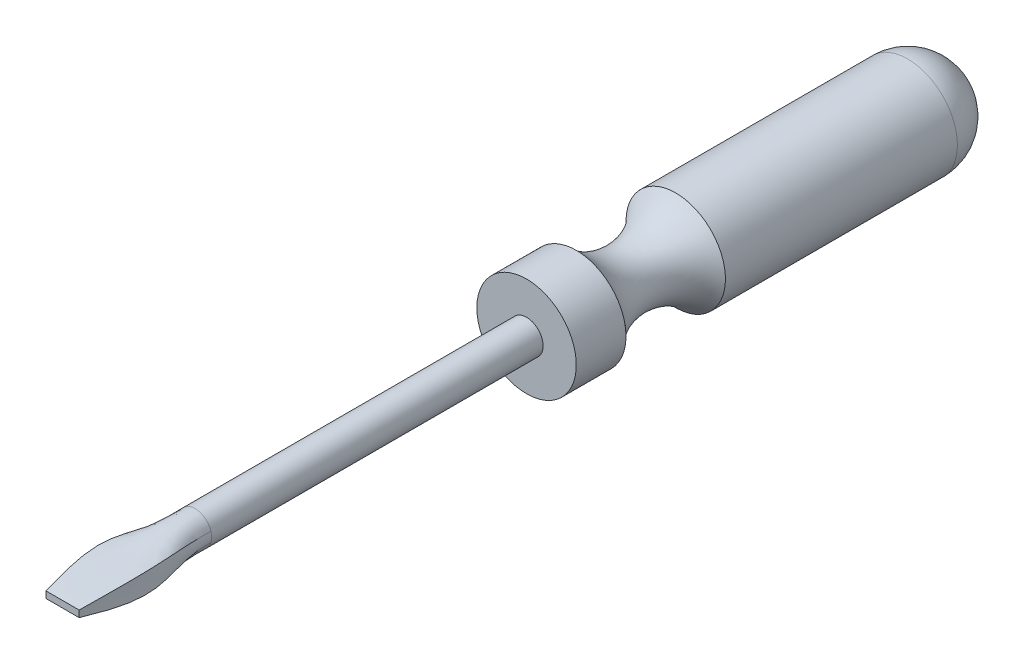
ISO-10303-21;
HEADER;
FILE_DESCRIPTION(('STEP AP214'),'2;1');
FILE_NAME('part.step','',(''),(''),'','','');
FILE_SCHEMA(('AUTOMOTIVE_DESIGN { 1 0 10303 214 1 1 1 1 }'));
ENDSEC;
DATA;
#1=APPLICATION_CONTEXT('core data for automotive mechanical design processes');
#2=APPLICATION_PROTOCOL_DEFINITION('international standard','automotive_design',2000,#1);
#3=PRODUCT_CONTEXT('',#1,'mechanical');
#4=PRODUCT('Part','Part','',(#3));
#5=PRODUCT_RELATED_PRODUCT_CATEGORY('part','',(#4));
#6=PRODUCT_DEFINITION_FORMATION('','',#4);
#7=PRODUCT_DEFINITION_CONTEXT('part definition',#1,'design');
#8=PRODUCT_DEFINITION('design','',#6,#7);
#9=PRODUCT_DEFINITION_SHAPE('','',#8);
#10=(LENGTH_UNIT() NAMED_UNIT(*) SI_UNIT(.MILLI.,.METRE.));
#11=(NAMED_UNIT(*) PLANE_ANGLE_UNIT() SI_UNIT($,.RADIAN.));
#12=(NAMED_UNIT(*) SI_UNIT($,.STERADIAN.) SOLID_ANGLE_UNIT());
#13=UNCERTAINTY_MEASURE_WITH_UNIT(LENGTH_MEASURE(1.E-05),#10,'distance_accuracy_value','');
#14=(GEOMETRIC_REPRESENTATION_CONTEXT(3) GLOBAL_UNCERTAINTY_ASSIGNED_CONTEXT((#13)) GLOBAL_UNIT_ASSIGNED_CONTEXT((#10,
#11,#12)) REPRESENTATION_CONTEXT('',''));
#15=CARTESIAN_POINT('',(0.,0.,0.));
#16=DIRECTION('',(0.,0.,1.));
#17=DIRECTION('',(1.,0.,0.));
#18=AXIS2_PLACEMENT_3D('',#15,#16,#17);
#19=CARTESIAN_POINT('',(0.,0.,0.));
#20=DIRECTION('',(0.,0.,-1.));
#21=DIRECTION('',(-1.,0.,0.));
#22=AXIS2_PLACEMENT_3D('',#19,#20,#21);
#23=PLANE('',#22);
#24=CARTESIAN_POINT('',(0.,0.,0.));
#25=DIRECTION('',(0.,0.,-1.));
#26=DIRECTION('',(-1.,0.,0.));
#27=AXIS2_PLACEMENT_3D('',#24,#25,#26);
#28=CIRCLE('',#27,19.05);
#29=CARTESIAN_POINT('',(-19.05,0.,0.));
#30=VERTEX_POINT('',#29);
#31=EDGE_CURVE('E163',#30,#30,#28,.T.);
#32=ORIENTED_EDGE('',*,*,#31,.F.);
#33=EDGE_LOOP('',(#32));
#34=FACE_BOUND('',#33,.T.);
#35=CARTESIAN_POINT('',(0.,0.,0.));
#36=DIRECTION('',(0.,0.,-1.));
#37=DIRECTION('',(-1.,0.,0.));
#38=AXIS2_PLACEMENT_3D('',#35,#36,#37);
#39=CIRCLE('',#38,6.35);
#40=CARTESIAN_POINT('',(-6.35,0.,0.));
#41=VERTEX_POINT('',#40);
#42=EDGE_CURVE('E12',#41,#41,#39,.F.);
#43=ORIENTED_EDGE('',*,*,#42,.F.);
#44=EDGE_LOOP('',(#43));
#45=FACE_BOUND('',#44,.T.);
#46=ADVANCED_FACE('F154',(#34,#45),#23,.F.);
#47=CARTESIAN_POINT('',(0.,0.,0.));
#48=DIRECTION('',(0.,0.,-1.));
#49=DIRECTION('',(-1.,0.,0.));
#50=AXIS2_PLACEMENT_3D('',#47,#48,#49);
#51=CYLINDRICAL_SURFACE('',#50,19.05);
#52=CARTESIAN_POINT('',(0.,0.,-19.05));
#53=DIRECTION('',(0.,0.,-1.));
#54=DIRECTION('',(-1.,0.,0.));
#55=AXIS2_PLACEMENT_3D('',#52,#53,#54);
#56=CIRCLE('',#55,19.05);
#57=CARTESIAN_POINT('',(-19.05,0.,-19.05));
#58=VERTEX_POINT('',#57);
#59=EDGE_CURVE('E457',#58,#58,#56,.T.);
#60=ORIENTED_EDGE('',*,*,#59,.F.);
#61=EDGE_LOOP('',(#60));
#62=FACE_BOUND('',#61,.T.);
#63=ORIENTED_EDGE('',*,*,#31,.T.);
#64=EDGE_LOOP('',(#63));
#65=FACE_BOUND('',#64,.T.);
#66=ADVANCED_FACE('F423',(#62,#65),#51,.T.);
#67=CARTESIAN_POINT('',(0.,0.,-38.1));
#68=DIRECTION('',(0.,0.,-1.));
#69=DIRECTION('',(-1.,0.,0.));
#70=AXIS2_PLACEMENT_3D('',#67,#68,#69);
#71=TOROIDAL_SURFACE('',#70,35.8505208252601,25.4);
#72=CARTESIAN_POINT('',(0.,0.,-57.15));
#73=DIRECTION('',(0.,0.,-1.));
#74=DIRECTION('',(-1.,0.,0.));
#75=AXIS2_PLACEMENT_3D('',#72,#73,#74);
#76=CIRCLE('',#75,19.05);
#77=CARTESIAN_POINT('',(-19.05,0.,-57.15));
#78=VERTEX_POINT('',#77);
#79=EDGE_CURVE('E459',#78,#78,#76,.T.);
#80=ORIENTED_EDGE('',*,*,#79,.F.);
#81=EDGE_LOOP('',(#80));
#82=FACE_BOUND('',#81,.T.);
#83=ORIENTED_EDGE('',*,*,#59,.T.);
#84=EDGE_LOOP('',(#83));
#85=FACE_BOUND('',#84,.T.);
#86=ADVANCED_FACE('F428',(#82,#85),#71,.F.);
#87=CARTESIAN_POINT('',(0.,0.,0.));
#88=DIRECTION('',(0.,0.,-1.));
#89=DIRECTION('',(-1.,0.,0.));
#90=AXIS2_PLACEMENT_3D('',#87,#88,#89);
#91=CYLINDRICAL_SURFACE('',#90,19.05);
#92=CARTESIAN_POINT('',(0.,0.,-146.05));
#93=DIRECTION('',(0.,0.,-1.));
#94=DIRECTION('',(-1.,0.,0.));
#95=AXIS2_PLACEMENT_3D('',#92,#93,#94);
#96=CIRCLE('',#95,19.05);
#97=CARTESIAN_POINT('',(-19.05,0.,-146.05));
#98=VERTEX_POINT('',#97);
#99=EDGE_CURVE('E242',#98,#98,#96,.T.);
#100=ORIENTED_EDGE('',*,*,#99,.F.);
#101=EDGE_LOOP('',(#100));
#102=FACE_BOUND('',#101,.T.);
#103=ORIENTED_EDGE('',*,*,#79,.T.);
#104=EDGE_LOOP('',(#103));
#105=FACE_BOUND('',#104,.T.);
#106=ADVANCED_FACE('F440',(#102,#105),#91,.T.);
#107=CARTESIAN_POINT('',(0.,0.,-146.05));
#108=DIRECTION('',(0.,0.,-1.));
#109=DIRECTION('',(1.,0.,0.));
#110=AXIS2_PLACEMENT_3D('',#107,#108,#109);
#111=SPHERICAL_SURFACE('',#110,19.05);
#112=ORIENTED_EDGE('',*,*,#99,.T.);
#113=EDGE_LOOP('',(#112));
#114=FACE_BOUND('',#113,.T.);
#115=ADVANCED_FACE('F436',(#114),#111,.T.);
#116=CARTESIAN_POINT('',(0.,0.,144.960512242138));
#117=DIRECTION('',(0.,0.,-1.));
#118=DIRECTION('',(-1.,0.,0.));
#119=AXIS2_PLACEMENT_3D('',#116,#117,#118);
#120=CYLINDRICAL_SURFACE('',#119,6.35);
#121=ORIENTED_EDGE('',*,*,#42,.T.);
#122=EDGE_LOOP('',(#121));
#123=FACE_BOUND('',#122,.T.);
#124=CARTESIAN_POINT('',(6.06423657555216,1.88349004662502,127.));
#125=CARTESIAN_POINT('',(5.58596095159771,3.42338484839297,127.));
#126=CARTESIAN_POINT('',(4.61525119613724,4.81003866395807,127.));
#127=CARTESIAN_POINT('',(3.22482013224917,5.83395313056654,127.000000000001));
#128=CARTESIAN_POINT('',(0.,6.86623014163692,126.999999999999));
#129=CARTESIAN_POINT('',(-3.22482013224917,5.83395313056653,127.000000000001));
#130=CARTESIAN_POINT('',(-4.61525119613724,4.8100386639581,127.000000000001));
#131=CARTESIAN_POINT('',(-5.58596095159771,3.42338484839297,127.));
#132=CARTESIAN_POINT('',(-6.06423657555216,1.88349004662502,127.));
#133=B_SPLINE_CURVE_WITH_KNOTS('',5,(#124,#125,#126,#127,#128,#129,#130,#131,#132),
.UNSPECIFIED.,.F.,.F.,(6,3,6),(0.,0.5,1.),.UNSPECIFIED.);
#134=CARTESIAN_POINT('',(6.06451282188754,1.88357672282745,127.));
#135=VERTEX_POINT('',#134);
#136=CARTESIAN_POINT('',(-6.06453522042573,1.88358375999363,127.));
#137=VERTEX_POINT('',#136);
#138=EDGE_CURVE('E223',#135,#137,#133,.T.);
#139=ORIENTED_EDGE('',*,*,#138,.F.);
#140=CARTESIAN_POINT('',(0.,0.,127.));
#141=DIRECTION('',(0.,0.,1.));
#142=DIRECTION('',(1.,0.,0.));
#143=AXIS2_PLACEMENT_3D('',#140,#141,#142);
#144=CIRCLE('',#143,6.35);
#145=CARTESIAN_POINT('',(6.06453920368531,-1.8835850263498,127.));
#146=VERTEX_POINT('',#145);
#147=EDGE_CURVE('E171',#135,#146,#144,.F.);
#148=ORIENTED_EDGE('',*,*,#147,.T.);
#149=CARTESIAN_POINT('',(0.,0.,127.));
#150=DIRECTION('',(0.,0.,-1.));
#151=DIRECTION('',(1.,0.,0.));
#152=AXIS2_PLACEMENT_3D('',#149,#150,#151);
#153=CIRCLE('',#152,6.35);
#154=CARTESIAN_POINT('',(-6.06451679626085,-1.88357798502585,127.));
#155=VERTEX_POINT('',#154);
#156=EDGE_CURVE('E176',#146,#155,#153,.T.);
#157=ORIENTED_EDGE('',*,*,#156,.T.);
#158=CARTESIAN_POINT('',(0.,0.,127.));
#159=DIRECTION('',(0.,0.,-1.));
#160=DIRECTION('',(1.,0.,0.));
#161=AXIS2_PLACEMENT_3D('',#158,#159,#160);
#162=CIRCLE('',#161,6.35);
#163=EDGE_CURVE('E206',#155,#137,#162,.T.);
#164=ORIENTED_EDGE('',*,*,#163,.T.);
#165=EDGE_LOOP('',(#139,#148,#157,#164));
#166=FACE_BOUND('',#165,.T.);
#167=ADVANCED_FACE('F253',(#123,#166),#120,.T.);
#168=CARTESIAN_POINT('',(0.,0.,177.8));
#169=DIRECTION('',(0.,0.,-1.));
#170=DIRECTION('',(-1.,0.,0.));
#171=AXIS2_PLACEMENT_3D('',#168,#169,#170);
#172=PLANE('',#171);
#173=DIRECTION('',(0.,-1.,0.));
#174=VECTOR('',#173,1.);
#175=CARTESIAN_POINT('',(-6.35,-1.27,177.8));
#176=LINE('',#175,#174);
#177=CARTESIAN_POINT('',(-6.35,1.27,177.8));
#178=VERTEX_POINT('',#177);
#179=CARTESIAN_POINT('',(-6.35,-1.27,177.8));
#180=VERTEX_POINT('',#179);
#181=EDGE_CURVE('E203',#178,#180,#176,.T.);
#182=ORIENTED_EDGE('',*,*,#181,.T.);
#183=DIRECTION('',(1.,0.,0.));
#184=VECTOR('',#183,1.);
#185=CARTESIAN_POINT('',(-6.35,-1.27,177.8));
#186=LINE('',#185,#184);
#187=CARTESIAN_POINT('',(6.35,-1.27,177.8));
#188=VERTEX_POINT('',#187);
#189=EDGE_CURVE('E215',#180,#188,#186,.T.);
#190=ORIENTED_EDGE('',*,*,#189,.T.);
#191=DIRECTION('',(0.,1.,0.));
#192=VECTOR('',#191,1.);
#193=CARTESIAN_POINT('',(6.35,-1.27,177.8));
#194=LINE('',#193,#192);
#195=CARTESIAN_POINT('',(6.35,1.27,177.8));
#196=VERTEX_POINT('',#195);
#197=EDGE_CURVE('E224',#188,#196,#194,.T.);
#198=ORIENTED_EDGE('',*,*,#197,.T.);
#199=DIRECTION('',(-1.,0.,0.));
#200=VECTOR('',#199,1.);
#201=CARTESIAN_POINT('',(-6.35,1.27,177.8));
#202=LINE('',#201,#200);
#203=EDGE_CURVE('E231',#196,#178,#202,.T.);
#204=ORIENTED_EDGE('',*,*,#203,.T.);
#205=EDGE_LOOP('',(#182,#190,#198,#204));
#206=FACE_BOUND('',#205,.T.);
#207=ADVANCED_FACE('F229',(#206),#172,.F.);
#208=CARTESIAN_POINT('',(-6.35,1.27,177.8));
#209=CARTESIAN_POINT('',(-7.24669827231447,2.08925590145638,172.722712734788));
#210=CARTESIAN_POINT('',(-8.14339654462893,2.90851180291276,167.645425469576));
#211=CARTESIAN_POINT('',(-8.84574568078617,3.57213975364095,162.566781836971));
#212=CARTESIAN_POINT('',(-9.47201583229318,4.27572492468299,152.420781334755));
#213=CARTESIAN_POINT('',(-7.77376045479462,3.11791183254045,142.258557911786));
#214=CARTESIAN_POINT('',(-6.06423657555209,1.88349004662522,137.189031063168));
#215=CARTESIAN_POINT('',(-6.06423657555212,1.88349004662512,132.094515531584));
#216=CARTESIAN_POINT('',(-6.06423657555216,1.88349004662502,127.));
#217=CARTESIAN_POINT('',(-5.08,1.27,177.8));
#218=CARTESIAN_POINT('',(-5.73409838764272,1.9566424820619,172.73260214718));
#219=CARTESIAN_POINT('',(-6.38819677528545,2.6432849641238,167.66520429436));
#220=CARTESIAN_POINT('',(-6.91844596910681,3.24060620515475,162.59150536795));
#221=CARTESIAN_POINT('',(-7.48261829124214,4.07658671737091,152.435631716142));
#222=CARTESIAN_POINT('',(-6.56548424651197,3.84423469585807,142.204393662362));
#223=CARTESIAN_POINT('',(-5.58596107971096,3.42338443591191,137.051229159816));
#224=CARTESIAN_POINT('',(-5.58596101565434,3.42338464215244,132.025614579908));
#225=CARTESIAN_POINT('',(-5.58596095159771,3.42338484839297,127.));
#226=CARTESIAN_POINT('',(-3.81,1.27,177.8));
#227=CARTESIAN_POINT('',(-4.26390620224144,1.83722593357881,172.740019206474));
#228=CARTESIAN_POINT('',(-4.71781240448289,2.40445186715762,167.680038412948));
#229=CARTESIAN_POINT('',(-5.09716550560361,2.94206483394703,162.610048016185));
#230=CARTESIAN_POINT('',(-5.55690203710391,3.89726551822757,152.446769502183));
#231=CARTESIAN_POINT('',(-5.12494133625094,4.4982783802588,142.163770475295));
#232=CARTESIAN_POINT('',(-4.61525138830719,4.8100380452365,136.947877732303));
#233=CARTESIAN_POINT('',(-4.61525129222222,4.8100383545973,131.973938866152));
#234=CARTESIAN_POINT('',(-4.61525119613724,4.8100386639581,127.000000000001));
#235=CARTESIAN_POINT('',(-2.54000000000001,1.27,177.8));
#236=CARTESIAN_POINT('',(-2.82985979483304,1.74904794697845,172.74496391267));
#237=CARTESIAN_POINT('',(-3.11971958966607,2.2280958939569,167.68992782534));
#238=CARTESIAN_POINT('',(-3.36624948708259,2.72161986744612,162.622409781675));
#239=CARTESIAN_POINT('',(-3.68546389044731,3.76485353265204,152.454194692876));
#240=CARTESIAN_POINT('',(-3.48642822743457,4.98122865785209,142.136688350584));
#241=CARTESIAN_POINT('',(-3.22482034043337,5.83395246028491,136.878976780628));
#242=CARTESIAN_POINT('',(-3.22482023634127,5.83395279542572,131.939488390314));
#243=CARTESIAN_POINT('',(-3.22482013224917,5.83395313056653,127.000000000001));
#244=CARTESIAN_POINT('',(0.,1.27,177.8));
#245=CARTESIAN_POINT('',(1.26419076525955E-08,1.6601497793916,172.749908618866));
#246=CARTESIAN_POINT('',(2.52838261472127E-08,2.05029955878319,167.699817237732));
#247=CARTESIAN_POINT('',(3.16047873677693E-08,2.499374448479,162.634771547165));
#248=CARTESIAN_POINT('',(1.89836698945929E-08,3.63136009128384,152.46161988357));
#249=CARTESIAN_POINT('',(-6.92396696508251E-08,5.46812336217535,142.109606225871));
#250=CARTESIAN_POINT('',(-1.76156029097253E-07,6.86622957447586,136.81007582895));
#251=CARTESIAN_POINT('',(-8.8078016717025E-08,6.86622985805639,131.905037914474));
#252=CARTESIAN_POINT('',(0.,6.86623014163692,126.999999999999));
#253=CARTESIAN_POINT('',(2.53999999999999,1.27,177.8));
#254=CARTESIAN_POINT('',(2.8298598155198,1.74904791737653,172.74496391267));
#255=CARTESIAN_POINT('',(3.11971963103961,2.22809583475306,167.689927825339));
#256=CARTESIAN_POINT('',(3.36624953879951,2.72161979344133,162.622409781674));
#257=CARTESIAN_POINT('',(3.6854639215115,3.76485348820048,152.454194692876));
#258=CARTESIAN_POINT('',(3.48642811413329,4.98122881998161,142.136688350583));
#259=CARTESIAN_POINT('',(3.22482005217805,5.83395287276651,136.878976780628));
#260=CARTESIAN_POINT('',(3.22482009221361,5.83395300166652,131.939488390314));
#261=CARTESIAN_POINT('',(3.22482013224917,5.83395313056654,127.000000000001));
#262=CARTESIAN_POINT('',(3.81,1.27,177.8));
#263=CARTESIAN_POINT('',(4.26390621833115,1.83722589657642,172.740019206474));
#264=CARTESIAN_POINT('',(4.7178124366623,2.40445179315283,167.680038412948));
#265=CARTESIAN_POINT('',(5.09716554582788,2.94206474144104,162.610048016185));
#266=CARTESIAN_POINT('',(5.55690206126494,3.89726546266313,152.446769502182));
#267=CARTESIAN_POINT('',(5.12494124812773,4.49827858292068,142.163770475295));
#268=CARTESIAN_POINT('',(4.61525116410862,4.81003856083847,136.947877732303));
#269=CARTESIAN_POINT('',(4.61525118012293,4.81003861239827,131.973938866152));
#270=CARTESIAN_POINT('',(4.61525119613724,4.81003866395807,127.));
#271=CARTESIAN_POINT('',(5.08,1.27,177.8));
#272=CARTESIAN_POINT('',(5.73409839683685,1.95664245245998,172.73260214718));
#273=CARTESIAN_POINT('',(6.38819679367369,2.64328490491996,167.66520429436));
#274=CARTESIAN_POINT('',(6.91844599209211,3.24060613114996,162.59150536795));
#275=CARTESIAN_POINT('',(7.48261830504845,4.07658667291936,152.435631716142));
#276=CARTESIAN_POINT('',(6.56548419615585,3.84423485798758,142.204393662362));
#277=CARTESIAN_POINT('',(5.58596095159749,3.42338484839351,137.051229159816));
#278=CARTESIAN_POINT('',(5.5859609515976,3.42338484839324,132.025614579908));
#279=CARTESIAN_POINT('',(5.58596095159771,3.42338484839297,127.));
#280=CARTESIAN_POINT('',(6.35,1.27,177.8));
#281=CARTESIAN_POINT('',(7.24669827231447,2.08925590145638,172.722712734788));
#282=CARTESIAN_POINT('',(8.14339654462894,2.90851180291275,167.645425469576));
#283=CARTESIAN_POINT('',(8.84574568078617,3.57213975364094,162.566781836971));
#284=CARTESIAN_POINT('',(9.4720158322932,4.27572492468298,152.420781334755));
#285=CARTESIAN_POINT('',(7.77376045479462,3.11791183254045,142.258557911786));
#286=CARTESIAN_POINT('',(6.06423657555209,1.88349004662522,137.189031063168));
#287=CARTESIAN_POINT('',(6.06423657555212,1.88349004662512,132.094515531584));
#288=CARTESIAN_POINT('',(6.06423657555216,1.88349004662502,127.));
#289=B_SPLINE_SURFACE_WITH_KNOTS('',5,5,((#208,#209,#210,#211,#212,#213,#214,#215,#216),(#217,
#218,#219,#220,#221,#222,#223,#224,#225),(#226,#227,#228,#229,#230,#231,#232,#233,#234),(#235,
#236,#237,#238,#239,#240,#241,#242,#243),(#244,#245,#246,#247,#248,#249,#250,#251,#252),(#253,
#254,#255,#256,#257,#258,#259,#260,#261),(#262,#263,#264,#265,#266,#267,#268,#269,#270),(#271,
#272,#273,#274,#275,#276,#277,#278,#279),(#280,#281,#282,#283,#284,#285,#286,#287,#288)),
.UNSPECIFIED.,.F.,.F.,.F.,(6,3,6),(6,3,6),(0.,0.5,1.),(0.,0.500823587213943,1.),.UNSPECIFIED.);
#290=CARTESIAN_POINT('',(-6.35,1.27,177.8));
#291=CARTESIAN_POINT('',(-7.24669827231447,2.08925590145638,172.722712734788));
#292=CARTESIAN_POINT('',(-8.14339654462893,2.90851180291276,167.645425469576));
#293=CARTESIAN_POINT('',(-8.84574568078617,3.57213975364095,162.566781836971));
#294=CARTESIAN_POINT('',(-9.47201583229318,4.27572492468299,152.420781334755));
#295=CARTESIAN_POINT('',(-7.77376045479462,3.11791183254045,142.258557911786));
#296=CARTESIAN_POINT('',(-6.06423657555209,1.88349004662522,137.189031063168));
#297=CARTESIAN_POINT('',(-6.06423657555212,1.88349004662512,132.094515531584));
#298=CARTESIAN_POINT('',(-6.06423657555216,1.88349004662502,127.));
#299=B_SPLINE_CURVE_WITH_KNOTS('',5,(#290,#291,#292,#293,#294,#295,#296,#297,#298),
.UNSPECIFIED.,.F.,.F.,(6,3,6),(0.,0.500823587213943,1.),.UNSPECIFIED.);
#300=EDGE_CURVE('E157',#178,#137,#299,.T.);
#301=CARTESIAN_POINT('',(6.35,1.27,177.8));
#302=CARTESIAN_POINT('',(7.24669827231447,2.08925590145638,172.722712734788));
#303=CARTESIAN_POINT('',(8.14339654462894,2.90851180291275,167.645425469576));
#304=CARTESIAN_POINT('',(8.84574568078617,3.57213975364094,162.566781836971));
#305=CARTESIAN_POINT('',(9.4720158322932,4.27572492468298,152.420781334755));
#306=CARTESIAN_POINT('',(7.77376045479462,3.11791183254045,142.258557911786));
#307=CARTESIAN_POINT('',(6.06423657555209,1.88349004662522,137.189031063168));
#308=CARTESIAN_POINT('',(6.06423657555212,1.88349004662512,132.094515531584));
#309=CARTESIAN_POINT('',(6.06423657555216,1.88349004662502,127.));
#310=B_SPLINE_CURVE_WITH_KNOTS('',5,(#301,#302,#303,#304,#305,#306,#307,#308,#309),
.UNSPECIFIED.,.F.,.F.,(6,3,6),(0.,0.500823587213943,1.),.UNSPECIFIED.);
#311=EDGE_CURVE('E292',#196,#135,#310,.T.);
#312=ORIENTED_EDGE('',*,*,#138,.T.);
#313=ORIENTED_EDGE('',*,*,#300,.F.);
#314=ORIENTED_EDGE('',*,*,#203,.F.);
#315=ORIENTED_EDGE('',*,*,#311,.T.);
#316=EDGE_LOOP('',(#312,#313,#314,#315));
#317=FACE_BOUND('',#316,.T.);
#318=ADVANCED_FACE('F252',(#317),#289,.T.);
#319=CARTESIAN_POINT('',(-6.35,-1.27,177.8));
#320=CARTESIAN_POINT('',(-7.24669827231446,-2.08925590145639,172.722712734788));
#321=CARTESIAN_POINT('',(-8.14339654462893,-2.90851180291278,167.645425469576));
#322=CARTESIAN_POINT('',(-8.84574568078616,-3.57213975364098,162.566781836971));
#323=CARTESIAN_POINT('',(-9.47201583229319,-4.27572492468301,152.420781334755));
#324=CARTESIAN_POINT('',(-7.77376045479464,-3.11791183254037,142.258557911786));
#325=CARTESIAN_POINT('',(-6.06423657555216,-1.88349004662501,137.189031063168));
#326=CARTESIAN_POINT('',(-6.06423657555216,-1.88349004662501,132.094515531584));
#327=CARTESIAN_POINT('',(-6.06423657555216,-1.88349004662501,127.));
#328=CARTESIAN_POINT('',(-6.35,-0.762000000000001,177.8));
#329=CARTESIAN_POINT('',(-7.22715967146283,-1.25158025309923,172.726967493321));
#330=CARTESIAN_POINT('',(-8.10431934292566,-1.74116050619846,167.653934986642));
#331=CARTESIAN_POINT('',(-8.79689917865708,-2.13835063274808,162.577418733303));
#332=CARTESIAN_POINT('',(-9.44267580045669,-2.56247177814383,152.427170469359));
#333=CARTESIAN_POINT('',(-7.88077324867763,-1.8815547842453,142.235254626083));
#334=CARTESIAN_POINT('',(-6.29111694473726,-1.15300769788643,137.129744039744));
#335=CARTESIAN_POINT('',(-6.29111698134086,-1.15300758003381,132.064872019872));
#336=CARTESIAN_POINT('',(-6.29111701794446,-1.15300746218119,127.));
#337=CARTESIAN_POINT('',(-6.35000000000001,-0.254000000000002,177.800000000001));
#338=CARTESIAN_POINT('',(-7.21710953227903,-0.416851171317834,172.729094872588));
#339=CARTESIAN_POINT('',(-8.08421906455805,-0.579702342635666,167.658189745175));
#340=CARTESIAN_POINT('',(-8.77177383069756,-0.711927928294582,162.582737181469));
#341=CARTESIAN_POINT('',(-9.42758406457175,-0.853643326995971,152.43036503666));
#342=CARTESIAN_POINT('',(-7.93581779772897,-0.629059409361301,142.223602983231));
#343=CARTESIAN_POINT('',(-6.40781820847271,-0.388310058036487,137.100100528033));
#344=CARTESIAN_POINT('',(-6.40781824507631,-0.388309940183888,132.050050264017));
#345=CARTESIAN_POINT('',(-6.40781828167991,-0.38830982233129,127.));
#346=CARTESIAN_POINT('',(-6.35000000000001,0.254,177.800000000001));
#347=CARTESIAN_POINT('',(-7.21710952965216,0.416851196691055,172.729094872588));
#348=CARTESIAN_POINT('',(-8.08421905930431,0.57970239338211,167.658189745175));
#349=CARTESIAN_POINT('',(-8.77177382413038,0.711927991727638,162.582737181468));
#350=CARTESIAN_POINT('',(-9.42758406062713,0.853643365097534,152.43036503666));
#351=CARTESIAN_POINT('',(-7.93581781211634,0.62905927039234,142.223602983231));
#352=CARTESIAN_POINT('',(-6.40781824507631,0.388309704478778,137.100100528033));
#353=CARTESIAN_POINT('',(-6.40781826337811,0.388309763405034,132.050050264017));
#354=CARTESIAN_POINT('',(-6.40781828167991,0.38830982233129,127.));
#355=CARTESIAN_POINT('',(-6.35,0.762000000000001,177.8));
#356=CARTESIAN_POINT('',(-7.22715966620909,1.25158027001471,172.726967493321));
#357=CARTESIAN_POINT('',(-8.10431933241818,1.74116054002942,167.653934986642));
#358=CARTESIAN_POINT('',(-8.79689916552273,2.13835067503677,162.577418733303));
#359=CARTESIAN_POINT('',(-9.44267579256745,2.56247180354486,152.427170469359));
#360=CARTESIAN_POINT('',(-7.88077327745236,1.88155469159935,142.235254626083));
#361=CARTESIAN_POINT('',(-6.29111701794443,1.15300746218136,137.129744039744));
#362=CARTESIAN_POINT('',(-6.29111701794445,1.15300746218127,132.064872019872));
#363=CARTESIAN_POINT('',(-6.29111701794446,1.15300746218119,127.));
#364=CARTESIAN_POINT('',(-6.35,1.27,177.8));
#365=CARTESIAN_POINT('',(-7.24669827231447,2.08925590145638,172.722712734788));
#366=CARTESIAN_POINT('',(-8.14339654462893,2.90851180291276,167.645425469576));
#367=CARTESIAN_POINT('',(-8.84574568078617,3.57213975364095,162.566781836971));
#368=CARTESIAN_POINT('',(-9.47201583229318,4.27572492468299,152.420781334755));
#369=CARTESIAN_POINT('',(-7.77376045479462,3.11791183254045,142.258557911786));
#370=CARTESIAN_POINT('',(-6.06423657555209,1.88349004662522,137.189031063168));
#371=CARTESIAN_POINT('',(-6.06423657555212,1.88349004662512,132.094515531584));
#372=CARTESIAN_POINT('',(-6.06423657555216,1.88349004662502,127.));
#373=B_SPLINE_SURFACE_WITH_KNOTS('',5,5,((#319,#320,#321,#322,#323,#324,#325,#326,#327),(#328,
#329,#330,#331,#332,#333,#334,#335,#336),(#337,#338,#339,#340,#341,#342,#343,#344,#345),(#346,
#347,#348,#349,#350,#351,#352,#353,#354),(#355,#356,#357,#358,#359,#360,#361,#362,#363),(#364,
#365,#366,#367,#368,#369,#370,#371,#372)),.UNSPECIFIED.,.F.,.F.,.F.,(6,6),(6,3,6),(0.,1.),(0.,
0.500823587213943,1.),.UNSPECIFIED.);
#374=CARTESIAN_POINT('',(-6.35,-1.27,177.8));
#375=CARTESIAN_POINT('',(-7.24669827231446,-2.08925590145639,172.722712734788));
#376=CARTESIAN_POINT('',(-8.14339654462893,-2.90851180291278,167.645425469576));
#377=CARTESIAN_POINT('',(-8.84574568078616,-3.57213975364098,162.566781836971));
#378=CARTESIAN_POINT('',(-9.47201583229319,-4.27572492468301,152.420781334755));
#379=CARTESIAN_POINT('',(-7.77376045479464,-3.11791183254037,142.258557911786));
#380=CARTESIAN_POINT('',(-6.06423657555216,-1.88349004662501,137.189031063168));
#381=CARTESIAN_POINT('',(-6.06423657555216,-1.88349004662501,132.094515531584));
#382=CARTESIAN_POINT('',(-6.06423657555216,-1.88349004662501,127.));
#383=B_SPLINE_CURVE_WITH_KNOTS('',5,(#374,#375,#376,#377,#378,#379,#380,#381,#382),
.UNSPECIFIED.,.F.,.F.,(6,3,6),(0.,0.500823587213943,1.),.UNSPECIFIED.);
#384=EDGE_CURVE('E197',#180,#155,#383,.T.);
#385=ORIENTED_EDGE('',*,*,#300,.T.);
#386=ORIENTED_EDGE('',*,*,#163,.F.);
#387=ORIENTED_EDGE('',*,*,#384,.F.);
#388=ORIENTED_EDGE('',*,*,#181,.F.);
#389=EDGE_LOOP('',(#385,#386,#387,#388));
#390=FACE_BOUND('',#389,.T.);
#391=ADVANCED_FACE('F201',(#390),#373,.T.);
#392=CARTESIAN_POINT('',(6.35,-1.27,177.8));
#393=CARTESIAN_POINT('',(7.24669827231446,-2.08925590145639,172.722712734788));
#394=CARTESIAN_POINT('',(8.14339654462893,-2.90851180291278,167.645425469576));
#395=CARTESIAN_POINT('',(8.84574568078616,-3.57213975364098,162.566781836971));
#396=CARTESIAN_POINT('',(9.47201583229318,-4.27572492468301,152.420781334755));
#397=CARTESIAN_POINT('',(7.77376045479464,-3.11791183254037,142.258557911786));
#398=CARTESIAN_POINT('',(6.06423657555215,-1.88349004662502,137.189031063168));
#399=CARTESIAN_POINT('',(6.06423657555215,-1.88349004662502,132.094515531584));
#400=CARTESIAN_POINT('',(6.06423657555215,-1.88349004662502,127.));
#401=CARTESIAN_POINT('',(5.08,-1.27,177.8));
#402=CARTESIAN_POINT('',(5.73409838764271,-1.95664248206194,172.73260214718));
#403=CARTESIAN_POINT('',(6.38819677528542,-2.64328496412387,167.66520429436));
#404=CARTESIAN_POINT('',(6.91844596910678,-3.24060620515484,162.59150536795));
#405=CARTESIAN_POINT('',(7.48261829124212,-4.07658671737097,152.435631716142));
#406=CARTESIAN_POINT('',(6.56548424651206,-3.84423469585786,142.204393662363));
#407=CARTESIAN_POINT('',(5.58596107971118,-3.42338443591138,137.051229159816));
#408=CARTESIAN_POINT('',(5.58596101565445,-3.42338464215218,132.025614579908));
#409=CARTESIAN_POINT('',(5.58596095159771,-3.42338484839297,127.));
#410=CARTESIAN_POINT('',(3.81,-1.27,177.8));
#411=CARTESIAN_POINT('',(4.26390620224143,-1.83722593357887,172.740019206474));
#412=CARTESIAN_POINT('',(4.71781240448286,-2.40445186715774,167.680038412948));
#413=CARTESIAN_POINT('',(5.09716550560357,-2.94206483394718,162.610048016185));
#414=CARTESIAN_POINT('',(5.55690203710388,-3.89726551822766,152.446769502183));
#415=CARTESIAN_POINT('',(5.12494133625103,-4.49827838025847,142.163770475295));
#416=CARTESIAN_POINT('',(4.61525138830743,-4.81003804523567,136.947877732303));
#417=CARTESIAN_POINT('',(4.61525129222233,-4.81003835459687,131.973938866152));
#418=CARTESIAN_POINT('',(4.61525119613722,-4.81003866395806,127.));
#419=CARTESIAN_POINT('',(2.54000000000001,-1.27,177.8));
#420=CARTESIAN_POINT('',(2.82985979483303,-1.74904794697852,172.74496391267));
#421=CARTESIAN_POINT('',(3.11971958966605,-2.22809589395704,167.68992782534));
#422=CARTESIAN_POINT('',(3.36624948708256,-2.7216198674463,162.622409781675));
#423=CARTESIAN_POINT('',(3.68546389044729,-3.76485353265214,152.454194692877));
#424=CARTESIAN_POINT('',(3.48642822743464,-4.98122865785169,142.136688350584));
#425=CARTESIAN_POINT('',(3.22482034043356,-5.83395246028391,136.878976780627));
#426=CARTESIAN_POINT('',(3.22482023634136,-5.83395279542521,131.939488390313));
#427=CARTESIAN_POINT('',(3.22482013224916,-5.8339531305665,127.));
#428=CARTESIAN_POINT('',(0.,-1.27,177.8));
#429=CARTESIAN_POINT('',(-1.2641911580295E-08,-1.66014977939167,172.749908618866));
#430=CARTESIAN_POINT('',(-2.52838296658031E-08,-2.05029955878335,167.699817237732));
#431=CARTESIAN_POINT('',(-3.16047905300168E-08,-2.49937444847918,162.634771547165));
#432=CARTESIAN_POINT('',(-1.89836725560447E-08,-3.63136009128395,152.461619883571));
#433=CARTESIAN_POINT('',(6.92396668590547E-08,-5.46812336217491,142.109606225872));
#434=CARTESIAN_POINT('',(1.76156026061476E-07,-6.86622957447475,136.810075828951));
#435=CARTESIAN_POINT('',(8.80780136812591E-08,-6.86622985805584,131.905037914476));
#436=CARTESIAN_POINT('',(0.,-6.86623014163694,127.));
#437=CARTESIAN_POINT('',(-2.54,-1.27,177.8));
#438=CARTESIAN_POINT('',(-2.82985981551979,-1.7490479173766,172.74496391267));
#439=CARTESIAN_POINT('',(-3.11971963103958,-2.22809583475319,167.68992782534));
#440=CARTESIAN_POINT('',(-3.36624953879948,-2.72161979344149,162.622409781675));
#441=CARTESIAN_POINT('',(-3.68546392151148,-3.76485348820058,152.454194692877));
#442=CARTESIAN_POINT('',(-3.48642811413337,-4.98122881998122,142.136688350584));
#443=CARTESIAN_POINT('',(-3.22482005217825,-5.83395287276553,136.878976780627));
#444=CARTESIAN_POINT('',(-3.22482009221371,-5.83395300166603,131.939488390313));
#445=CARTESIAN_POINT('',(-3.22482013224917,-5.83395313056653,127.));
#446=CARTESIAN_POINT('',(-3.81,-1.27,177.8));
#447=CARTESIAN_POINT('',(-4.26390621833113,-1.83722589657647,172.740019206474));
#448=CARTESIAN_POINT('',(-4.71781243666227,-2.40445179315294,167.680038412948));
#449=CARTESIAN_POINT('',(-5.09716554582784,-2.94206474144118,162.610048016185));
#450=CARTESIAN_POINT('',(-5.55690206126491,-3.89726546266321,152.446769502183));
#451=CARTESIAN_POINT('',(-5.12494124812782,-4.49827858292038,142.163770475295));
#452=CARTESIAN_POINT('',(-4.61525116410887,-4.81003856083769,136.947877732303));
#453=CARTESIAN_POINT('',(-4.61525118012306,-4.81003861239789,131.973938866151));
#454=CARTESIAN_POINT('',(-4.61525119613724,-4.81003866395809,127.));
#455=CARTESIAN_POINT('',(-5.08,-1.27,177.8));
#456=CARTESIAN_POINT('',(-5.73409839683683,-1.95664245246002,172.73260214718));
#457=CARTESIAN_POINT('',(-6.38819679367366,-2.64328490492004,167.66520429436));
#458=CARTESIAN_POINT('',(-6.91844599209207,-3.24060613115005,162.59150536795));
#459=CARTESIAN_POINT('',(-7.48261830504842,-4.07658667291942,152.435631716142));
#460=CARTESIAN_POINT('',(-6.56548419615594,-3.84423485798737,142.204393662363));
#461=CARTESIAN_POINT('',(-5.58596095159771,-3.42338484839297,137.051229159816));
#462=CARTESIAN_POINT('',(-5.58596095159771,-3.42338484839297,132.025614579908));
#463=CARTESIAN_POINT('',(-5.58596095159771,-3.42338484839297,127.));
#464=CARTESIAN_POINT('',(-6.35,-1.27,177.8));
#465=CARTESIAN_POINT('',(-7.24669827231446,-2.08925590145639,172.722712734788));
#466=CARTESIAN_POINT('',(-8.14339654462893,-2.90851180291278,167.645425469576));
#467=CARTESIAN_POINT('',(-8.84574568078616,-3.57213975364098,162.566781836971));
#468=CARTESIAN_POINT('',(-9.47201583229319,-4.27572492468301,152.420781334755));
#469=CARTESIAN_POINT('',(-7.77376045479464,-3.11791183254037,142.258557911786));
#470=CARTESIAN_POINT('',(-6.06423657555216,-1.88349004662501,137.189031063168));
#471=CARTESIAN_POINT('',(-6.06423657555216,-1.88349004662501,132.094515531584));
#472=CARTESIAN_POINT('',(-6.06423657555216,-1.88349004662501,127.));
#473=B_SPLINE_SURFACE_WITH_KNOTS('',5,5,((#392,#393,#394,#395,#396,#397,#398,#399,#400),(#401,
#402,#403,#404,#405,#406,#407,#408,#409),(#410,#411,#412,#413,#414,#415,#416,#417,#418),(#419,
#420,#421,#422,#423,#424,#425,#426,#427),(#428,#429,#430,#431,#432,#433,#434,#435,#436),(#437,
#438,#439,#440,#441,#442,#443,#444,#445),(#446,#447,#448,#449,#450,#451,#452,#453,#454),(#455,
#456,#457,#458,#459,#460,#461,#462,#463),(#464,#465,#466,#467,#468,#469,#470,#471,#472)),
.UNSPECIFIED.,.F.,.F.,.F.,(6,3,6),(6,3,6),(0.,0.5,1.),(0.,0.500823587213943,1.),.UNSPECIFIED.);
#474=CARTESIAN_POINT('',(6.35,-1.27,177.8));
#475=CARTESIAN_POINT('',(7.24669827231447,-2.08925590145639,172.722712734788));
#476=CARTESIAN_POINT('',(8.14339654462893,-2.90851180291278,167.645425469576));
#477=CARTESIAN_POINT('',(8.84574568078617,-3.57213975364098,162.566781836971));
#478=CARTESIAN_POINT('',(9.47201583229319,-4.27572492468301,152.420781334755));
#479=CARTESIAN_POINT('',(7.77376045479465,-3.11791183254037,142.258557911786));
#480=CARTESIAN_POINT('',(6.06423657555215,-1.88349004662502,137.189031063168));
#481=CARTESIAN_POINT('',(6.06423657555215,-1.88349004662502,132.094515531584));
#482=CARTESIAN_POINT('',(6.06423657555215,-1.88349004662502,127.));
#483=B_SPLINE_CURVE_WITH_KNOTS('',5,(#474,#475,#476,#477,#478,#479,#480,#481,#482),
.UNSPECIFIED.,.F.,.F.,(6,3,6),(0.,0.500823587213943,1.),.UNSPECIFIED.);
#484=EDGE_CURVE('E210',#188,#146,#483,.T.);
#485=ORIENTED_EDGE('',*,*,#384,.T.);
#486=ORIENTED_EDGE('',*,*,#156,.F.);
#487=ORIENTED_EDGE('',*,*,#484,.F.);
#488=ORIENTED_EDGE('',*,*,#189,.F.);
#489=EDGE_LOOP('',(#485,#486,#487,#488));
#490=FACE_BOUND('',#489,.T.);
#491=ADVANCED_FACE('F217',(#490),#473,.T.);
#492=CARTESIAN_POINT('',(6.35,1.27,177.8));
#493=CARTESIAN_POINT('',(7.24669827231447,2.08925590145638,172.722712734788));
#494=CARTESIAN_POINT('',(8.14339654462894,2.90851180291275,167.645425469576));
#495=CARTESIAN_POINT('',(8.84574568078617,3.57213975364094,162.566781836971));
#496=CARTESIAN_POINT('',(9.4720158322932,4.27572492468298,152.420781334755));
#497=CARTESIAN_POINT('',(7.77376045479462,3.11791183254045,142.258557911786));
#498=CARTESIAN_POINT('',(6.06423657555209,1.88349004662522,137.189031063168));
#499=CARTESIAN_POINT('',(6.06423657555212,1.88349004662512,132.094515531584));
#500=CARTESIAN_POINT('',(6.06423657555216,1.88349004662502,127.));
#501=CARTESIAN_POINT('',(6.35,0.761999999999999,177.8));
#502=CARTESIAN_POINT('',(7.22715967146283,1.25158025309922,172.726967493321));
#503=CARTESIAN_POINT('',(8.10431934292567,1.74116050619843,167.653934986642));
#504=CARTESIAN_POINT('',(8.79689917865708,2.13835063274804,162.577418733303));
#505=CARTESIAN_POINT('',(9.44267580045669,2.5624717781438,152.427170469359));
#506=CARTESIAN_POINT('',(7.88077324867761,1.88155478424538,142.235254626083));
#507=CARTESIAN_POINT('',(6.29111694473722,1.15300769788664,137.129744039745));
#508=CARTESIAN_POINT('',(6.29111698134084,1.15300758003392,132.064872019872));
#509=CARTESIAN_POINT('',(6.29111701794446,1.15300746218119,127.));
#510=CARTESIAN_POINT('',(6.35,0.254,177.800000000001));
#511=CARTESIAN_POINT('',(7.21710953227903,0.416851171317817,172.729094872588));
#512=CARTESIAN_POINT('',(8.08421906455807,0.579702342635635,167.658189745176));
#513=CARTESIAN_POINT('',(8.77177383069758,0.711927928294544,162.582737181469));
#514=CARTESIAN_POINT('',(9.42758406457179,0.853643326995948,152.430365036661));
#515=CARTESIAN_POINT('',(7.93581779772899,0.629059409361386,142.223602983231));
#516=CARTESIAN_POINT('',(6.4078182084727,0.388310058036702,137.100100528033));
#517=CARTESIAN_POINT('',(6.40781824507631,0.388309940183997,132.050050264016));
#518=CARTESIAN_POINT('',(6.40781828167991,0.388309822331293,127.));
#519=CARTESIAN_POINT('',(6.34999999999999,-0.254000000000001,177.800000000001));
#520=CARTESIAN_POINT('',(7.21710952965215,-0.416851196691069,172.729094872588));
#521=CARTESIAN_POINT('',(8.0842190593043,-0.579702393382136,167.658189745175));
#522=CARTESIAN_POINT('',(8.77177382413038,-0.71192799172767,162.582737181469));
#523=CARTESIAN_POINT('',(9.42758406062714,-0.853643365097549,152.430365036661));
#524=CARTESIAN_POINT('',(7.93581781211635,-0.629059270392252,142.223602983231));
#525=CARTESIAN_POINT('',(6.40781824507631,-0.388309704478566,137.100100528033));
#526=CARTESIAN_POINT('',(6.40781826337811,-0.388309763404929,132.050050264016));
#527=CARTESIAN_POINT('',(6.4078182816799,-0.388309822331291,127.));
#528=CARTESIAN_POINT('',(6.35,-0.762,177.8));
#529=CARTESIAN_POINT('',(7.22715966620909,-1.25158027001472,172.726967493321));
#530=CARTESIAN_POINT('',(8.10431933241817,-1.74116054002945,167.653934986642));
#531=CARTESIAN_POINT('',(8.79689916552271,-2.13835067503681,162.577418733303));
#532=CARTESIAN_POINT('',(9.44267579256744,-2.56247180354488,152.427170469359));
#533=CARTESIAN_POINT('',(7.88077327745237,-1.88155469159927,142.235254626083));
#534=CARTESIAN_POINT('',(6.29111701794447,-1.15300746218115,137.129744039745));
#535=CARTESIAN_POINT('',(6.29111701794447,-1.15300746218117,132.064872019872));
#536=CARTESIAN_POINT('',(6.29111701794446,-1.15300746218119,127.));
#537=CARTESIAN_POINT('',(6.35,-1.27,177.8));
#538=CARTESIAN_POINT('',(7.24669827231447,-2.08925590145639,172.722712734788));
#539=CARTESIAN_POINT('',(8.14339654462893,-2.90851180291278,167.645425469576));
#540=CARTESIAN_POINT('',(8.84574568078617,-3.57213975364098,162.566781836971));
#541=CARTESIAN_POINT('',(9.47201583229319,-4.27572492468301,152.420781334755));
#542=CARTESIAN_POINT('',(7.77376045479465,-3.11791183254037,142.258557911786));
#543=CARTESIAN_POINT('',(6.06423657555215,-1.88349004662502,137.189031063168));
#544=CARTESIAN_POINT('',(6.06423657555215,-1.88349004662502,132.094515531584));
#545=CARTESIAN_POINT('',(6.06423657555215,-1.88349004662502,127.));
#546=B_SPLINE_SURFACE_WITH_KNOTS('',5,5,((#492,#493,#494,#495,#496,#497,#498,#499,#500),(#501,
#502,#503,#504,#505,#506,#507,#508,#509),(#510,#511,#512,#513,#514,#515,#516,#517,#518),(#519,
#520,#521,#522,#523,#524,#525,#526,#527),(#528,#529,#530,#531,#532,#533,#534,#535,#536),(#537,
#538,#539,#540,#541,#542,#543,#544,#545)),.UNSPECIFIED.,.F.,.F.,.F.,(6,6),(6,3,6),(0.,1.),(0.,
0.500823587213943,1.),.UNSPECIFIED.);
#547=ORIENTED_EDGE('',*,*,#484,.T.);
#548=ORIENTED_EDGE('',*,*,#147,.F.);
#549=ORIENTED_EDGE('',*,*,#311,.F.);
#550=ORIENTED_EDGE('',*,*,#197,.F.);
#551=EDGE_LOOP('',(#547,#548,#549,#550));
#552=FACE_BOUND('',#551,.T.);
#553=ADVANCED_FACE('F254',(#552),#546,.T.);
#554=CLOSED_SHELL('',(#46,#66,#86,#106,#115,#167,#207,#318,#391,#491,#553));
#555=MANIFOLD_SOLID_BREP('B2',#554);
#556=ADVANCED_BREP_SHAPE_REPRESENTATION('',(#18,#555),#14);
#557=SHAPE_DEFINITION_REPRESENTATION(#9,#556);
ENDSEC;
END-ISO-10303-21;
